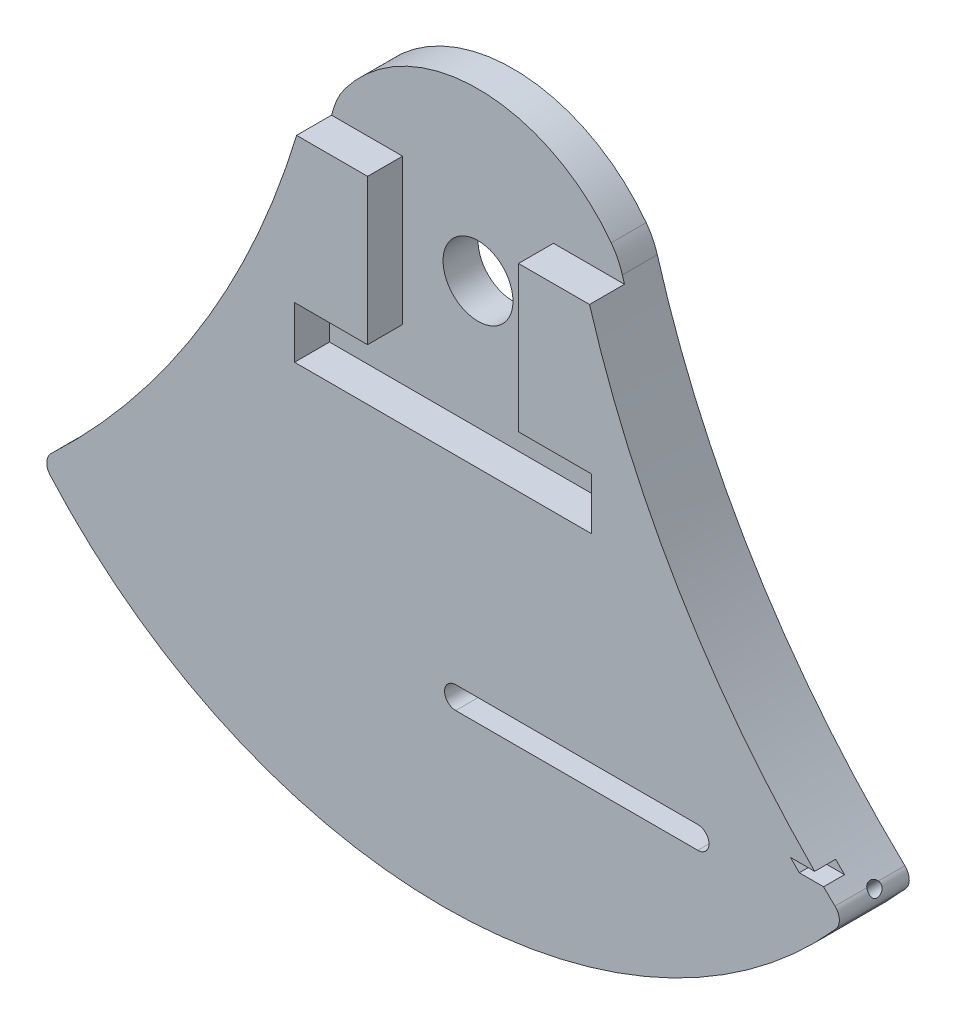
from build123d import *

# Parameters (mm, degrees)
BODY_DEPTH            = 10
SKETCH2_R             = 5
ATTACHMENT_HOLE_DEPTH = 96.00466041
WRAP1_SECTION_W       = 3
WRAP1_SECTION_H       = 6.4106076
WRAP1_ANGLE           = 84.831127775
FILLET3_R             = 2
FILLET4_R             = 2
HORIZ_SLOT_DEPTH      = 95.541676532
CUT_EXTRUDE15_DEPTH   = 3
CUT_EXTRUDE16_DEPTH   = 95.541676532
CUT_EXTRUDE17_DEPTH   = 5
FILLET5_R             = 10
SKETCH31_R            = 0.95
CUT_EXTRUDE24_DEPTH   = 95.541676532
SKETCH21_R            = 0.90381
CUT_EXTRUDE25_DEPTH   = 101.833036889
SKETCH33_R            = 1.625
CUT_EXTRUDE27_DEPTH   = 22.35


with BuildPart() as part:
    # Sketch1 → Body (new body)
    with BuildSketch(Plane.XY):
        with BuildLine():
            ThreePointArc((-57.453333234, -48.209070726), (-24.034507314, 1.033281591), (-16, 60))
            ThreePointArc((-16, 60), (0, 74.927440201), (16, 60))
            ThreePointArc((16, 60), (24.034507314, 1.033281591), (57.453333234, -48.209070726))
            ThreePointArc((57.453333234, -48.209070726), (0, -75), (-57.453333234, -48.209070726))
        make_face()
    extrude(amount=BODY_DEPTH)

    # Sketch2 → Attachment Hole (cut, through all)
    with BuildSketch(Plane.XY.offset(10)):
        Circle(SKETCH2_R)
    extrude(amount=-ATTACHMENT_HOLE_DEPTH, mode=Mode.SUBTRACT)

    # Wrap1 section (on wrap section) → Wrap1 (revolve, cut)
    with BuildSketch(Plane(origin=(0, 0, 0), x_dir=(0.7134885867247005, -0.7006668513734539, 0), z_dir=(0.7006668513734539, 0.7134885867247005, 0))):
        with Locations((73.5, -5.0694594)):
            Rectangle(WRAP1_SECTION_W, WRAP1_SECTION_H)
    revolve(axis=Axis((0, 0, 0), (0, 0, -1)), revolution_arc=WRAP1_ANGLE, mode=Mode.SUBTRACT)

    # Fillet3
    fillet3_edges = [part.edges().sort_by_distance(p)[0] for p in [
        (-57.453333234, -48.209070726, 5),
    ]]
    fillet(fillet3_edges, radius=FILLET3_R)

    # Fillet4
    fillet4_edges = [part.edges().sort_by_distance(p)[0] for p in [
        (57.453333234, -48.209070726, 5),
    ]]
    fillet(fillet4_edges, radius=FILLET4_R)

    # Sketch23 → Horiz Slot (cut, through all)
    with BuildSketch(Plane.XY.offset(10)):
        with BuildLine():
            Line((1.812113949, -46.609070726), (36.441177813, -46.609070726))
            ThreePointArc((36.441177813, -46.609070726), (38.041177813, -48.209070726), (36.441177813, -49.809070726))
            Line((36.441177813, -49.809070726), (1.812113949, -49.809070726))
            ThreePointArc((1.812113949, -49.809070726), (0.212113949, -48.209070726), (1.812113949, -46.609070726))
        make_face()
    extrude(amount=-HORIZ_SLOT_DEPTH, mode=Mode.SUBTRACT)

    # Sketch26 → Cut-Extrude15 (cut)
    with BuildSketch(Plane.XY.offset(10)):
        Polygon((54.427367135, -45.332225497), (50.951636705, -45.332225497), (49.699997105, -44.061296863), (53.150528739, -44.061296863), align=None)
    extrude(amount=-CUT_EXTRUDE15_DEPTH, mode=Mode.SUBTRACT)

    # Sketch27 → Cut-Extrude16 (cut, through all)
    with BuildSketch(Plane.XY.offset(10)):
        with BuildLine():
            ThreePointArc((-20.23143193, 12.535117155), (-15.927202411, 36.07245547), (-16, 60))
            ThreePointArc((-16, 60), (0, 74.927440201), (16, 60))
            ThreePointArc((16, 60), (15.927202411, 36.07245547), (20.23143193, 12.535117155))
            ThreePointArc((20.23143193, 12.535117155), (0, 23.8), (-20.23143193, 12.535117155))
        make_face()
    extrude(amount=-CUT_EXTRUDE16_DEPTH, mode=Mode.SUBTRACT)

    # Sketch17 → Cut-Extrude17 (cut)
    with BuildSketch(Plane.XY.offset(10)):
        with BuildLine():
            Line((-21.243201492, 10.060294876), (-10.792899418, 10.060294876))
            Line((-10.792899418, 10.060294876), (-10.792899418, -10.792899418))
            Line((-10.792899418, -10.792899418), (-21.241207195, -10.792899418))
            Line((-21.241207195, -10.792899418), (-21.241207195, -18.192446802))
            Line((-21.241207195, -18.192446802), (21.241207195, -18.192446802))
            Line((21.241207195, -18.192446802), (21.241207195, -10.792899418))
            Line((21.241207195, -10.792899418), (10.792899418, -10.792899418))
            Line((10.792899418, -10.792899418), (10.792899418, 10.060294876))
            Line((10.792899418, 10.060294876), (21.243201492, 10.060294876))
            ThreePointArc((21.243201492, 10.060294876), (18.825884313, 18.91221851), (16.918727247, 27.887892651))
            ThreePointArc((16.918727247, 27.887892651), (0, 34.895858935), (-16.918727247, 27.887892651))
            ThreePointArc((-16.918727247, 27.887892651), (-18.825884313, 18.91221851), (-21.243201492, 10.060294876))
        make_face()
    extrude(amount=-CUT_EXTRUDE17_DEPTH, mode=Mode.SUBTRACT)

    # Fillet5
    fillet5_edges = [part.edges().sort_by_distance(p)[0] for p in [
        (20.23143193, 12.535117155, 2.5),
        (-20.23143193, 12.535117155, 2.5),
    ]]
    fillet(fillet5_edges, radius=FILLET5_R)

    # Sketch31 → Cut-Extrude24 (cut, through all)
    with BuildSketch(Plane(origin=(0, 0, 0), x_dir=(0.7134885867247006, -0.7006668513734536, 0), z_dir=(-0.7006668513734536, -0.7134885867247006, 0))):
        with Locations((73.323950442, 4.61946028)):
            Circle(SKETCH31_R)
    extrude(amount=-CUT_EXTRUDE24_DEPTH, mode=Mode.SUBTRACT)

    # Sketch21 → Cut-Extrude25 (cut, through all)
    with BuildSketch(Plane(origin=(0, -58.989931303, 0), x_dir=(-1, 0, 0), z_dir=(0, -1, 0))):
        with Locations(Location((53.296998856, -5.37681, 0), (0, 0, 180))):
            Circle(SKETCH21_R)
    extrude(amount=-CUT_EXTRUDE25_DEPTH, mode=Mode.SUBTRACT)

    # Sketch33 → Cut-Extrude27 (cut)
    with BuildSketch(Plane(origin=(0, -28.585713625, 0), x_dir=(-1, 0, 0), z_dir=(0, -1, 0))):
        with Locations((53.296998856, -5.376810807)):
            Circle(SKETCH33_R)
    extrude(amount=CUT_EXTRUDE27_DEPTH, mode=Mode.SUBTRACT)


solid = part.part
